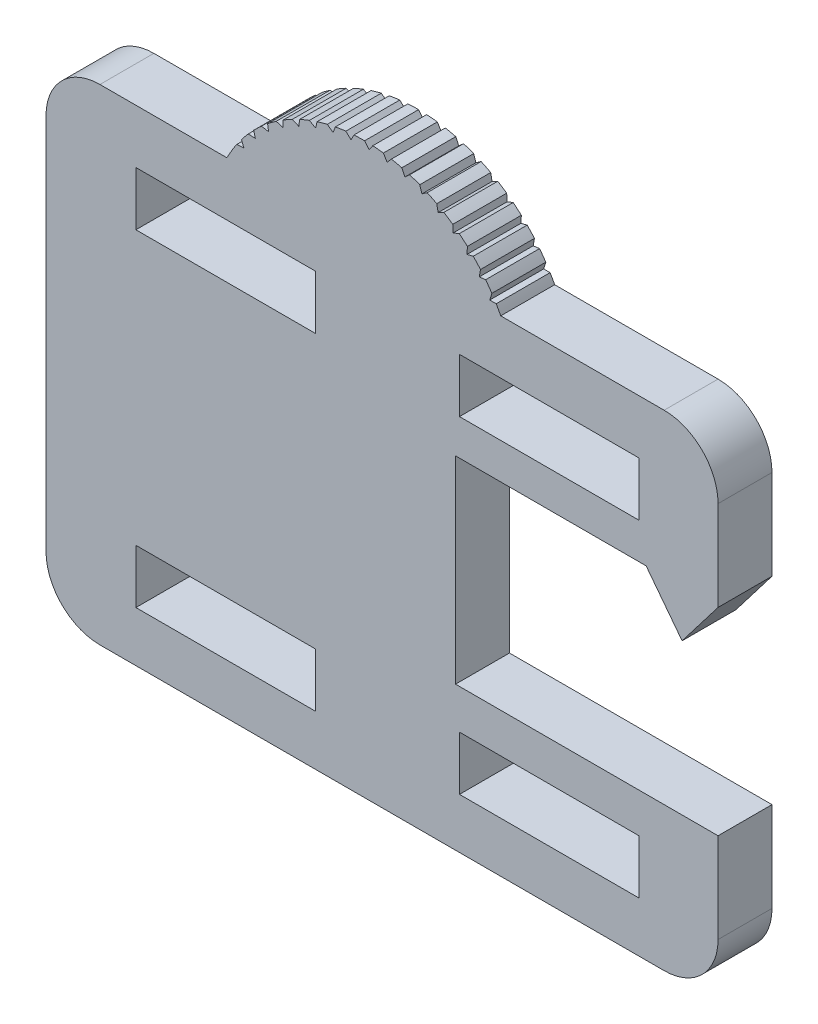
from build123d import *

# Parameters (mm, degrees)
ESQUISSE1_W                  = 10
ESQUISSE1_H                  = 3
BOSS_EXTRU_1_DEPTH           = 3
BOSS_EXTRU_2_DEPTH           = 3
CONG_1_R                     = 3
BOSS_EXTRU_3_DEPTH           = 3
ENL_V_MAT_EXTRU_1_DEPTH      = 3
R_P_TITION_CIRCULAIRE1_COUNT = 17
R_P_TITION_CIRCULAIRE1_ANGLE = 112


with BuildPart() as part:
    # Esquisse1 → Boss.-Extru.1 (new body)
    with BuildSketch(Plane.XY):
        Polygon((-8, -5.8), (-45.384651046, -5.8), (-45.384651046, 21.2), (-8, 21.2), (-8, 13.2), (-22.603381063, 13.2), (-22.603381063, 2.2), (-8, 2.2), align=None)
        with Locations((-17.384651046, -1.5)):
            Rectangle(ESQUISSE1_W, ESQUISSE1_H, mode=Mode.SUBTRACT)
        with Locations((-35.384651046, -1.5)):
            Rectangle(ESQUISSE1_W, ESQUISSE1_H, mode=Mode.SUBTRACT)
        with Locations((-17.384651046, 16.7)):
            Rectangle(ESQUISSE1_W, ESQUISSE1_H, mode=Mode.SUBTRACT)
        with Locations((-35.384651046, 16.7)):
            Rectangle(ESQUISSE1_W, ESQUISSE1_H, mode=Mode.SUBTRACT)
    extrude(amount=BOSS_EXTRU_1_DEPTH)

    # Esquisse2 → Boss.-Extru.2 (add)
    with BuildSketch(Plane.XY.offset(3)):
        Polygon((-8, 13.2), (-10, 10.59120588), (-12, 13.2), align=None)
    extrude(amount=-BOSS_EXTRU_2_DEPTH)

    # Cong_1
    cong_1_edges = [part.edges().sort_by_distance(p)[0] for p in [
        (-8, -5.8, 1.5),
        (-45.384651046, -5.8, 1.5),
        (-45.384651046, 21.2, 1.5),
        (-8, 21.2, 1.5),
    ]]
    fillet(cong_1_edges, radius=CONG_1_R)

    # Esquisse3 → Boss.-Extru.3 (add)
    with BuildSketch(Plane.XY.offset(3)):
        with BuildLine():
            Line((-20.090316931, 21.2), (-35.321952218, 21.2))
            ThreePointArc((-35.321952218, 21.2), (-27.706134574, 25.850073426), (-20.090316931, 21.2))
        make_face()
    extrude(amount=-BOSS_EXTRU_3_DEPTH)

    # Esquisse4 → Enl_v. mat.-Extru.1 (cut)
    with BuildSketch(Plane.XY.offset(3)):
        with BuildLine():
            Line((-20.342733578, 21.656661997), (-20.700829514, 21.656661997))
            Line((-20.700829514, 21.656661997), (-20.583086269, 22.038520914))
            ThreePointArc((-20.583086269, 22.038520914), (-20.460393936, 21.849175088), (-20.342733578, 21.656661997))
        make_face()
    enl_v_mat_extru_1 = extrude(amount=-ENL_V_MAT_EXTRU_1_DEPTH, mode=Mode.SUBTRACT)

    # R_p_tition circulaire1: Enl_v. mat.-Extru.1 ×17 about axis
    r_p_tition_circulaire1_axis = Axis((-27.706134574, 17.288503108, 0), (0, 0, 1))
    for i in range(1, R_P_TITION_CIRCULAIRE1_COUNT):
        add(enl_v_mat_extru_1.rotate(r_p_tition_circulaire1_axis, i * R_P_TITION_CIRCULAIRE1_ANGLE / (R_P_TITION_CIRCULAIRE1_COUNT - 1)), mode=Mode.SUBTRACT)


solid = part.part
